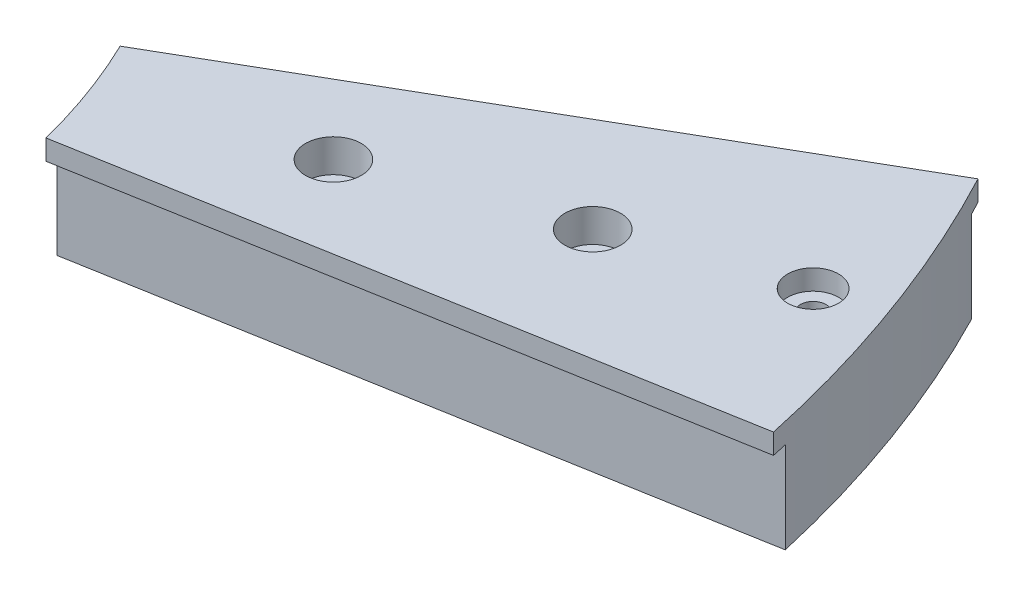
from build123d import *

# Parameters (mm, degrees)
BASE_EXTRUDE_DEPTH      = 17.4625
CUT_EXTRUDE2_DEPTH      = 14.2875
TAPLOC_501_D            = 4.0386
TAPLOC_501_DEPTH        = 27.305
TAPLOC_501_CBORE_D      = 7.9756
TAPLOC_501_CBORE_DEPTH  = 3.175
TAPLOC_501_TIP          = 1.213317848
CBORE10_OV1_D           = 5.6134
CBORE10_OV1_DEPTH       = 203.2
CBORE10_OV1_CBORE_D     = 8.73125
CBORE10_OV1_CBORE_DEPTH = 5.159375
CBORE10_OV2_D           = 5.6134
CBORE10_OV2_DEPTH       = 203.2
CBORE10_OV2_CBORE_D     = 8.73125
CBORE10_OV2_CBORE_DEPTH = 5.159375
HOLE3_D                 = 4.365625
HOLE3_DEPTH             = 14.2875
HOLE3_CBORE_D           = 4.7879
HOLE3_CBORE_DEPTH       = 7.14375
HOLE3_TIP               = 1.31156607
HOLE4_D                 = 4.365625
HOLE4_DEPTH             = 14.2875
HOLE4_CBORE_D           = 4.7879
HOLE4_CBORE_DEPTH       = 7.14375
HOLE4_TIP               = 1.31156607


with BuildPart() as part:
    # Sketch1 → Base-Extrude (new body)
    with BuildSketch(Plane(origin=(0, 0, 0), x_dir=(1, 0, 0), z_dir=(0, 1, 0))):
        with BuildLine():
            Line((87.207101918, 42.100151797), (172.560951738, 91.379219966))
            ThreePointArc((172.560951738, 91.379219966), (183.486730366, 66.783708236), (190.926788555, 40.919498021))
            Line((190.926788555, 40.919498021), (93.865971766, 23.805057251))
            ThreePointArc((93.865971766, 23.805057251), (90.997484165, 33.120375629), (87.207101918, 42.100151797))
        make_face()
    extrude(amount=BASE_EXTRUDE_DEPTH)

    # Sketch2 → Cut-Extrude2 (cut)
    with BuildSketch(Plane(origin=(0, 0, 0), x_dir=(1, 0, 0), z_dir=(0, 1, 0))):
        Polygon((76.2, 32.944241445), (200.025, 104.434638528), (200.025, 44.986878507), (76.2, 23.153190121), (76.2, 0), (228.6, 0), (228.6, 127), (76.2, 127), align=None)
    extrude(amount=CUT_EXTRUDE2_DEPTH, mode=Mode.SUBTRACT)

    # TAPLOC.501
    with Locations(Plane(origin=(153.811540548, 17.4625, -48.288091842), x_dir=(-1, 0, 0), z_dir=(0, 1, 0))):
        with Locations((-20.724617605, -15.237874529)):
            CounterBoreHole(TAPLOC_501_D / 2, TAPLOC_501_CBORE_D / 2, TAPLOC_501_CBORE_DEPTH, depth=TAPLOC_501_DEPTH)
            with Locations((0, 0, -(TAPLOC_501_DEPTH + TAPLOC_501_TIP / 2))):  # 118° drill point
                Cone(0, TAPLOC_501_D / 2, TAPLOC_501_TIP, mode=Mode.SUBTRACT)

    # CBORE10-OV1
    with Locations(Plane(origin=(140.421034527, 17.4625, -55.34699907), x_dir=(-1, 0, 0), z_dir=(0, 1, 0))):
        with Locations((21.080071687, 11.910440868)):
            CounterBoreHole(CBORE10_OV1_D / 2, CBORE10_OV1_CBORE_D / 2, CBORE10_OV1_CBORE_DEPTH, depth=CBORE10_OV1_DEPTH)

    # CBORE10-OV2
    with Locations(Plane(origin=(164.064378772, 17.4625, -66.071815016), x_dir=(-1, 0, 0), z_dir=(0, 1, 0))):
        with Locations((14.888175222, 11.776117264)):
            CounterBoreHole(CBORE10_OV2_D / 2, CBORE10_OV2_CBORE_D / 2, CBORE10_OV2_CBORE_DEPTH, depth=CBORE10_OV2_DEPTH)

    # Hole3
    with Locations(Plane(origin=(105.09618499, 0, -23.096524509), x_dir=(1, 0, 0), z_dir=(0, -1, 0))):
        with Locations((-2.80508315, -20.323472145)):
            CounterBoreHole(HOLE3_D / 2, HOLE3_CBORE_D / 2, HOLE3_CBORE_DEPTH, depth=HOLE3_DEPTH)
            with Locations((0, 0, -(HOLE3_DEPTH + HOLE3_TIP / 2))):  # 118° drill point
                Cone(0, HOLE3_D / 2, HOLE3_TIP, mode=Mode.SUBTRACT)

    # Hole4
    with Locations(Plane(origin=(179.869471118, 0, -24.795917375), x_dir=(1, 0, 0), z_dir=(0, -1, 0))):
        with Locations((-12.874753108, -26.259491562)):
            CounterBoreHole(HOLE4_D / 2, HOLE4_CBORE_D / 2, HOLE4_CBORE_DEPTH, depth=HOLE4_DEPTH)
            with Locations((0, 0, -(HOLE4_DEPTH + HOLE4_TIP / 2))):  # 118° drill point
                Cone(0, HOLE4_D / 2, HOLE4_TIP, mode=Mode.SUBTRACT)


solid = part.part
